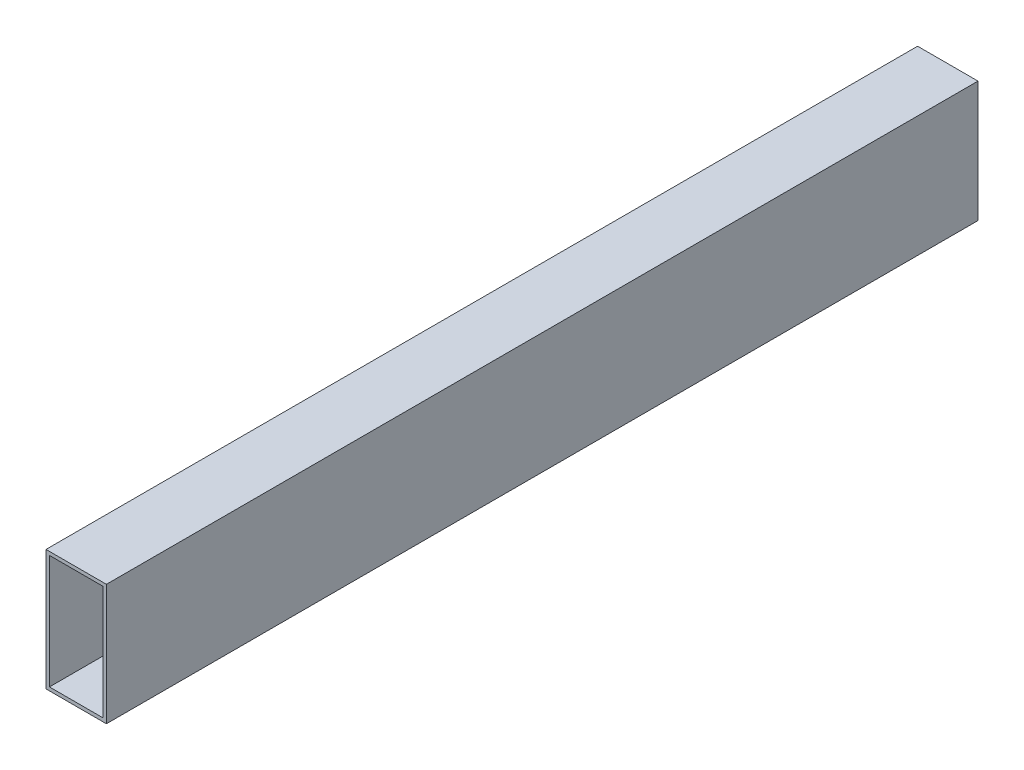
ISO-10303-21;
HEADER;
FILE_DESCRIPTION(('STEP AP214'),'2;1');
FILE_NAME('part.step','',(''),(''),'','','');
FILE_SCHEMA(('AUTOMOTIVE_DESIGN { 1 0 10303 214 1 1 1 1 }'));
ENDSEC;
DATA;
#1=APPLICATION_CONTEXT('core data for automotive mechanical design processes');
#2=APPLICATION_PROTOCOL_DEFINITION('international standard','automotive_design',2000,#1);
#3=PRODUCT_CONTEXT('',#1,'mechanical');
#4=PRODUCT('Part','Part','',(#3));
#5=PRODUCT_RELATED_PRODUCT_CATEGORY('part','',(#4));
#6=PRODUCT_DEFINITION_FORMATION('','',#4);
#7=PRODUCT_DEFINITION_CONTEXT('part definition',#1,'design');
#8=PRODUCT_DEFINITION('design','',#6,#7);
#9=PRODUCT_DEFINITION_SHAPE('','',#8);
#10=(LENGTH_UNIT() NAMED_UNIT(*) SI_UNIT(.MILLI.,.METRE.));
#11=(NAMED_UNIT(*) PLANE_ANGLE_UNIT() SI_UNIT($,.RADIAN.));
#12=(NAMED_UNIT(*) SI_UNIT($,.STERADIAN.) SOLID_ANGLE_UNIT());
#13=UNCERTAINTY_MEASURE_WITH_UNIT(LENGTH_MEASURE(1.E-05),#10,'distance_accuracy_value','');
#14=(GEOMETRIC_REPRESENTATION_CONTEXT(3) GLOBAL_UNCERTAINTY_ASSIGNED_CONTEXT((#13)) GLOBAL_UNIT_ASSIGNED_CONTEXT((#10,
#11,#12)) REPRESENTATION_CONTEXT('',''));
#15=CARTESIAN_POINT('',(0.,0.,0.));
#16=DIRECTION('',(0.,0.,1.));
#17=DIRECTION('',(1.,0.,0.));
#18=AXIS2_PLACEMENT_3D('',#15,#16,#17);
#19=CARTESIAN_POINT('',(0.,0.,1010.));
#20=DIRECTION('',(0.,0.,1.));
#21=DIRECTION('',(1.,0.,0.));
#22=AXIS2_PLACEMENT_3D('',#19,#20,#21);
#23=PLANE('',#22);
#24=DIRECTION('',(-1.,0.,0.));
#25=VECTOR('',#24,1.);
#26=CARTESIAN_POINT('',(70.,140.,1010.));
#27=LINE('',#26,#25);
#28=CARTESIAN_POINT('',(70.,140.,1010.));
#29=VERTEX_POINT('',#28);
#30=CARTESIAN_POINT('',(0.,140.,1010.));
#31=VERTEX_POINT('',#30);
#32=EDGE_CURVE('E133',#29,#31,#27,.T.);
#33=ORIENTED_EDGE('',*,*,#32,.T.);
#34=DIRECTION('',(0.,-1.,0.));
#35=VECTOR('',#34,1.);
#36=CARTESIAN_POINT('',(0.,140.,1010.));
#37=LINE('',#36,#35);
#38=CARTESIAN_POINT('',(0.,0.,1010.));
#39=VERTEX_POINT('',#38);
#40=EDGE_CURVE('E136',#31,#39,#37,.T.);
#41=ORIENTED_EDGE('',*,*,#40,.T.);
#42=DIRECTION('',(1.,0.,0.));
#43=VECTOR('',#42,1.);
#44=CARTESIAN_POINT('',(0.,0.,1010.));
#45=LINE('',#44,#43);
#46=CARTESIAN_POINT('',(70.,0.,1010.));
#47=VERTEX_POINT('',#46);
#48=EDGE_CURVE('E139',#39,#47,#45,.T.);
#49=ORIENTED_EDGE('',*,*,#48,.T.);
#50=DIRECTION('',(0.,1.,0.));
#51=VECTOR('',#50,1.);
#52=CARTESIAN_POINT('',(70.,0.,1010.));
#53=LINE('',#52,#51);
#54=EDGE_CURVE('E141',#47,#29,#53,.T.);
#55=ORIENTED_EDGE('',*,*,#54,.T.);
#56=EDGE_LOOP('',(#33,#41,#49,#55));
#57=FACE_BOUND('',#56,.T.);
#58=DIRECTION('',(-1.,0.,0.));
#59=VECTOR('',#58,1.);
#60=CARTESIAN_POINT('',(66.,136.,1010.));
#61=LINE('',#60,#59);
#62=CARTESIAN_POINT('',(66.,136.,1010.));
#63=VERTEX_POINT('',#62);
#64=CARTESIAN_POINT('',(4.,136.,1010.));
#65=VERTEX_POINT('',#64);
#66=EDGE_CURVE('E105',#63,#65,#61,.T.);
#67=ORIENTED_EDGE('',*,*,#66,.F.);
#68=DIRECTION('',(0.,1.,0.));
#69=VECTOR('',#68,1.);
#70=CARTESIAN_POINT('',(66.,4.,1010.));
#71=LINE('',#70,#69);
#72=CARTESIAN_POINT('',(66.,4.,1010.));
#73=VERTEX_POINT('',#72);
#74=EDGE_CURVE('E97',#73,#63,#71,.T.);
#75=ORIENTED_EDGE('',*,*,#74,.F.);
#76=DIRECTION('',(1.,0.,0.));
#77=VECTOR('',#76,1.);
#78=CARTESIAN_POINT('',(4.00000000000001,4.,1010.));
#79=LINE('',#78,#77);
#80=CARTESIAN_POINT('',(4.00000000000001,4.,1010.));
#81=VERTEX_POINT('',#80);
#82=EDGE_CURVE('E119',#81,#73,#79,.T.);
#83=ORIENTED_EDGE('',*,*,#82,.F.);
#84=DIRECTION('',(0.,-1.,0.));
#85=VECTOR('',#84,1.);
#86=CARTESIAN_POINT('',(4.,136.,1010.));
#87=LINE('',#86,#85);
#88=EDGE_CURVE('E117',#65,#81,#87,.T.);
#89=ORIENTED_EDGE('',*,*,#88,.F.);
#90=EDGE_LOOP('',(#67,#75,#83,#89));
#91=FACE_BOUND('',#90,.T.);
#92=ADVANCED_FACE('F32',(#57,#91),#23,.T.);
#93=CARTESIAN_POINT('',(0.,0.,0.));
#94=DIRECTION('',(0.,0.,1.));
#95=DIRECTION('',(1.,0.,0.));
#96=AXIS2_PLACEMENT_3D('',#93,#94,#95);
#97=PLANE('',#96);
#98=DIRECTION('',(-1.,0.,0.));
#99=VECTOR('',#98,1.);
#100=CARTESIAN_POINT('',(70.,140.,0.));
#101=LINE('',#100,#99);
#102=CARTESIAN_POINT('',(70.,140.,0.));
#103=VERTEX_POINT('',#102);
#104=CARTESIAN_POINT('',(0.,140.,0.));
#105=VERTEX_POINT('',#104);
#106=EDGE_CURVE('E113',#103,#105,#101,.T.);
#107=ORIENTED_EDGE('',*,*,#106,.F.);
#108=DIRECTION('',(0.,1.,0.));
#109=VECTOR('',#108,1.);
#110=CARTESIAN_POINT('',(70.,0.,0.));
#111=LINE('',#110,#109);
#112=CARTESIAN_POINT('',(70.,0.,0.));
#113=VERTEX_POINT('',#112);
#114=EDGE_CURVE('E137',#113,#103,#111,.T.);
#115=ORIENTED_EDGE('',*,*,#114,.F.);
#116=DIRECTION('',(1.,0.,0.));
#117=VECTOR('',#116,1.);
#118=CARTESIAN_POINT('',(0.,0.,0.));
#119=LINE('',#118,#117);
#120=CARTESIAN_POINT('',(0.,0.,0.));
#121=VERTEX_POINT('',#120);
#122=EDGE_CURVE('E148',#121,#113,#119,.T.);
#123=ORIENTED_EDGE('',*,*,#122,.F.);
#124=DIRECTION('',(0.,-1.,0.));
#125=VECTOR('',#124,1.);
#126=CARTESIAN_POINT('',(0.,140.,0.));
#127=LINE('',#126,#125);
#128=EDGE_CURVE('E146',#105,#121,#127,.T.);
#129=ORIENTED_EDGE('',*,*,#128,.F.);
#130=EDGE_LOOP('',(#107,#115,#123,#129));
#131=FACE_BOUND('',#130,.T.);
#132=DIRECTION('',(0.,1.,0.));
#133=VECTOR('',#132,1.);
#134=CARTESIAN_POINT('',(66.,4.,0.));
#135=LINE('',#134,#133);
#136=CARTESIAN_POINT('',(66.,4.,0.));
#137=VERTEX_POINT('',#136);
#138=CARTESIAN_POINT('',(66.,136.,0.));
#139=VERTEX_POINT('',#138);
#140=EDGE_CURVE('E55',#137,#139,#135,.T.);
#141=ORIENTED_EDGE('',*,*,#140,.T.);
#142=DIRECTION('',(-1.,0.,0.));
#143=VECTOR('',#142,1.);
#144=CARTESIAN_POINT('',(66.,136.,0.));
#145=LINE('',#144,#143);
#146=CARTESIAN_POINT('',(4.,136.,0.));
#147=VERTEX_POINT('',#146);
#148=EDGE_CURVE('E112',#139,#147,#145,.T.);
#149=ORIENTED_EDGE('',*,*,#148,.T.);
#150=DIRECTION('',(0.,-1.,0.));
#151=VECTOR('',#150,1.);
#152=CARTESIAN_POINT('',(4.,136.,0.));
#153=LINE('',#152,#151);
#154=CARTESIAN_POINT('',(4.00000000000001,4.,0.));
#155=VERTEX_POINT('',#154);
#156=EDGE_CURVE('E125',#147,#155,#153,.T.);
#157=ORIENTED_EDGE('',*,*,#156,.T.);
#158=DIRECTION('',(1.,0.,0.));
#159=VECTOR('',#158,1.);
#160=CARTESIAN_POINT('',(4.00000000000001,4.,0.));
#161=LINE('',#160,#159);
#162=EDGE_CURVE('E106',#155,#137,#161,.T.);
#163=ORIENTED_EDGE('',*,*,#162,.T.);
#164=EDGE_LOOP('',(#141,#149,#157,#163));
#165=FACE_BOUND('',#164,.T.);
#166=ADVANCED_FACE('F166',(#131,#165),#97,.F.);
#167=CARTESIAN_POINT('',(70.,140.,1010.));
#168=DIRECTION('',(0.,-1.,0.));
#169=DIRECTION('',(0.,0.,-1.));
#170=AXIS2_PLACEMENT_3D('',#167,#168,#169);
#171=PLANE('',#170);
#172=ORIENTED_EDGE('',*,*,#106,.T.);
#173=DIRECTION('',(0.,0.,-1.));
#174=VECTOR('',#173,1.);
#175=CARTESIAN_POINT('',(0.,140.,1010.));
#176=LINE('',#175,#174);
#177=EDGE_CURVE('E11',#31,#105,#176,.T.);
#178=ORIENTED_EDGE('',*,*,#177,.F.);
#179=ORIENTED_EDGE('',*,*,#32,.F.);
#180=DIRECTION('',(0.,0.,-1.));
#181=VECTOR('',#180,1.);
#182=CARTESIAN_POINT('',(70.,140.,1010.));
#183=LINE('',#182,#181);
#184=EDGE_CURVE('E143',#29,#103,#183,.T.);
#185=ORIENTED_EDGE('',*,*,#184,.T.);
#186=EDGE_LOOP('',(#172,#178,#179,#185));
#187=FACE_BOUND('',#186,.T.);
#188=ADVANCED_FACE('F34',(#187),#171,.F.);
#189=CARTESIAN_POINT('',(0.,140.,1010.));
#190=DIRECTION('',(1.,0.,0.));
#191=DIRECTION('',(0.,1.,0.));
#192=AXIS2_PLACEMENT_3D('',#189,#190,#191);
#193=PLANE('',#192);
#194=ORIENTED_EDGE('',*,*,#128,.T.);
#195=DIRECTION('',(0.,0.,-1.));
#196=VECTOR('',#195,1.);
#197=CARTESIAN_POINT('',(0.,0.,1010.));
#198=LINE('',#197,#196);
#199=EDGE_CURVE('E40',#39,#121,#198,.T.);
#200=ORIENTED_EDGE('',*,*,#199,.F.);
#201=ORIENTED_EDGE('',*,*,#40,.F.);
#202=ORIENTED_EDGE('',*,*,#177,.T.);
#203=EDGE_LOOP('',(#194,#200,#201,#202));
#204=FACE_BOUND('',#203,.T.);
#205=ADVANCED_FACE('F176',(#204),#193,.F.);
#206=CARTESIAN_POINT('',(0.,0.,1010.));
#207=DIRECTION('',(0.,1.,0.));
#208=DIRECTION('',(0.,0.,1.));
#209=AXIS2_PLACEMENT_3D('',#206,#207,#208);
#210=PLANE('',#209);
#211=ORIENTED_EDGE('',*,*,#122,.T.);
#212=DIRECTION('',(0.,0.,-1.));
#213=VECTOR('',#212,1.);
#214=CARTESIAN_POINT('',(70.,0.,1010.));
#215=LINE('',#214,#213);
#216=EDGE_CURVE('E153',#47,#113,#215,.T.);
#217=ORIENTED_EDGE('',*,*,#216,.F.);
#218=ORIENTED_EDGE('',*,*,#48,.F.);
#219=ORIENTED_EDGE('',*,*,#199,.T.);
#220=EDGE_LOOP('',(#211,#217,#218,#219));
#221=FACE_BOUND('',#220,.T.);
#222=ADVANCED_FACE('F160',(#221),#210,.F.);
#223=CARTESIAN_POINT('',(70.,0.,1010.));
#224=DIRECTION('',(-1.,0.,0.));
#225=DIRECTION('',(0.,0.,1.));
#226=AXIS2_PLACEMENT_3D('',#223,#224,#225);
#227=PLANE('',#226);
#228=ORIENTED_EDGE('',*,*,#114,.T.);
#229=ORIENTED_EDGE('',*,*,#184,.F.);
#230=ORIENTED_EDGE('',*,*,#54,.F.);
#231=ORIENTED_EDGE('',*,*,#216,.T.);
#232=EDGE_LOOP('',(#228,#229,#230,#231));
#233=FACE_BOUND('',#232,.T.);
#234=ADVANCED_FACE('F170',(#233),#227,.F.);
#235=CARTESIAN_POINT('',(66.,4.,1010.));
#236=DIRECTION('',(-1.,0.,0.));
#237=DIRECTION('',(0.,0.,1.));
#238=AXIS2_PLACEMENT_3D('',#235,#236,#237);
#239=PLANE('',#238);
#240=ORIENTED_EDGE('',*,*,#140,.F.);
#241=DIRECTION('',(0.,0.,-1.));
#242=VECTOR('',#241,1.);
#243=CARTESIAN_POINT('',(66.,4.,1010.));
#244=LINE('',#243,#242);
#245=EDGE_CURVE('E101',#73,#137,#244,.T.);
#246=ORIENTED_EDGE('',*,*,#245,.F.);
#247=ORIENTED_EDGE('',*,*,#74,.T.);
#248=DIRECTION('',(0.,0.,-1.));
#249=VECTOR('',#248,1.);
#250=CARTESIAN_POINT('',(66.,136.,1010.));
#251=LINE('',#250,#249);
#252=EDGE_CURVE('E100',#63,#139,#251,.T.);
#253=ORIENTED_EDGE('',*,*,#252,.T.);
#254=EDGE_LOOP('',(#240,#246,#247,#253));
#255=FACE_BOUND('',#254,.T.);
#256=ADVANCED_FACE('F99',(#255),#239,.T.);
#257=CARTESIAN_POINT('',(66.,136.,1010.));
#258=DIRECTION('',(0.,-1.,0.));
#259=DIRECTION('',(0.,0.,-1.));
#260=AXIS2_PLACEMENT_3D('',#257,#258,#259);
#261=PLANE('',#260);
#262=ORIENTED_EDGE('',*,*,#148,.F.);
#263=ORIENTED_EDGE('',*,*,#252,.F.);
#264=ORIENTED_EDGE('',*,*,#66,.T.);
#265=DIRECTION('',(0.,0.,-1.));
#266=VECTOR('',#265,1.);
#267=CARTESIAN_POINT('',(4.,136.,1010.));
#268=LINE('',#267,#266);
#269=EDGE_CURVE('E114',#65,#147,#268,.T.);
#270=ORIENTED_EDGE('',*,*,#269,.T.);
#271=EDGE_LOOP('',(#262,#263,#264,#270));
#272=FACE_BOUND('',#271,.T.);
#273=ADVANCED_FACE('F109',(#272),#261,.T.);
#274=CARTESIAN_POINT('',(4.,136.,1010.));
#275=DIRECTION('',(1.,0.,0.));
#276=DIRECTION('',(0.,1.,0.));
#277=AXIS2_PLACEMENT_3D('',#274,#275,#276);
#278=PLANE('',#277);
#279=ORIENTED_EDGE('',*,*,#156,.F.);
#280=ORIENTED_EDGE('',*,*,#269,.F.);
#281=ORIENTED_EDGE('',*,*,#88,.T.);
#282=DIRECTION('',(0.,0.,-1.));
#283=VECTOR('',#282,1.);
#284=CARTESIAN_POINT('',(4.00000000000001,4.,1010.));
#285=LINE('',#284,#283);
#286=EDGE_CURVE('E47',#81,#155,#285,.T.);
#287=ORIENTED_EDGE('',*,*,#286,.T.);
#288=EDGE_LOOP('',(#279,#280,#281,#287));
#289=FACE_BOUND('',#288,.T.);
#290=ADVANCED_FACE('F199',(#289),#278,.T.);
#291=CARTESIAN_POINT('',(4.00000000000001,4.,1010.));
#292=DIRECTION('',(0.,1.,0.));
#293=DIRECTION('',(0.,0.,1.));
#294=AXIS2_PLACEMENT_3D('',#291,#292,#293);
#295=PLANE('',#294);
#296=ORIENTED_EDGE('',*,*,#162,.F.);
#297=ORIENTED_EDGE('',*,*,#286,.F.);
#298=ORIENTED_EDGE('',*,*,#82,.T.);
#299=ORIENTED_EDGE('',*,*,#245,.T.);
#300=EDGE_LOOP('',(#296,#297,#298,#299));
#301=FACE_BOUND('',#300,.T.);
#302=ADVANCED_FACE('F203',(#301),#295,.T.);
#303=CLOSED_SHELL('',(#92,#166,#188,#205,#222,#234,#256,#273,#290,#302));
#304=MANIFOLD_SOLID_BREP('B2',#303);
#305=ADVANCED_BREP_SHAPE_REPRESENTATION('',(#18,#304),#14);
#306=SHAPE_DEFINITION_REPRESENTATION(#9,#305);
ENDSEC;
END-ISO-10303-21;
